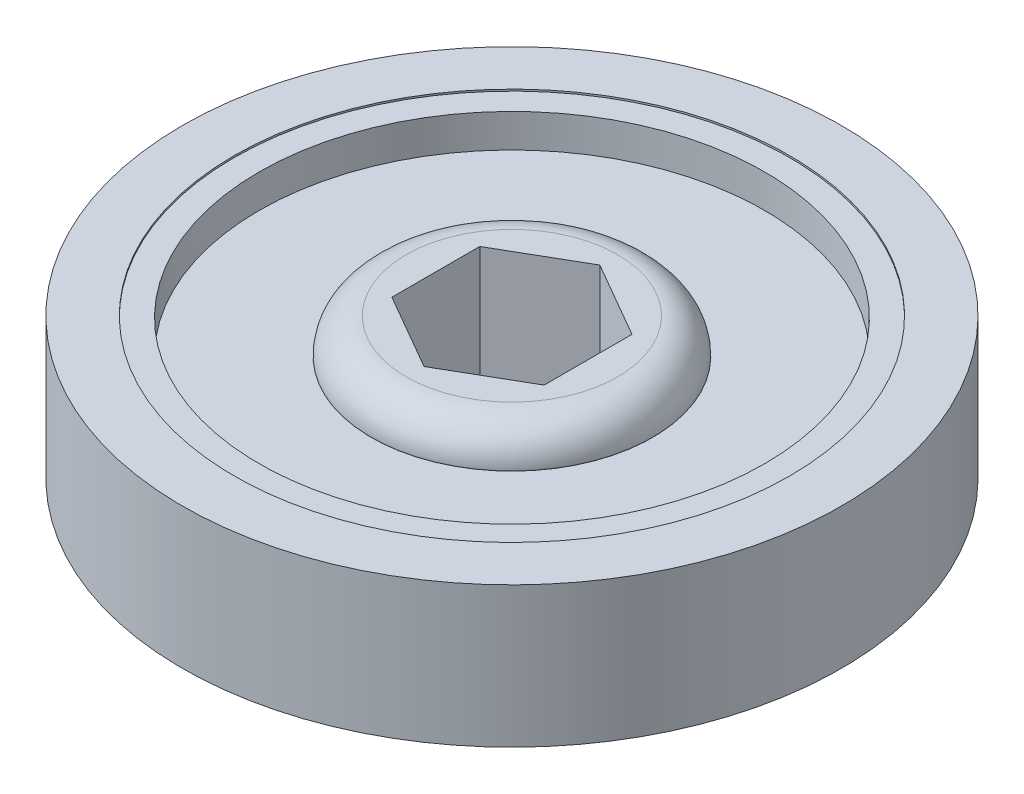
from build123d import *

# Parameters (mm, degrees)
CUT_EXTRUDE1_DEPTH = 36.175217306


with BuildPart() as part:
    # Sketch2 → Revolve1 (revolve)
    with BuildSketch(Plane.XY, mode=Mode.PRIVATE) as revolve1_sk:
        with BuildLine():
            Line((0, 0), (7.6454, 0))
            ThreePointArc((7.6454, 0), (9.423490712, -0.736509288), (10.16, -2.5146))
            Line((10.16, -2.5146), (10.16, -2.54))
            Line((10.16, -2.54), (18.26278597, -2.54))
            Line((18.26278597, -2.54), (18.26278597, -0.127))
            Line((18.26278597, -0.127), (20.060873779, -0.127))
            Line((20.060873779, -0.127), (20.060873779, 0))
            Line((20.060873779, 0), (23.8125, 0))
            Line((23.8125, 0), (23.8125, -10.16))
            Line((23.8125, -10.16), (20.060873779, -10.16))
            Line((20.060873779, -10.16), (20.060873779, -10.033))
            Line((20.060873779, -10.033), (18.26278597, -10.033))
            Line((18.26278597, -10.033), (18.26278597, -7.62))
            Line((18.26278597, -7.62), (10.16, -7.62))
            Line((10.16, -7.62), (10.16, -7.6454))
            ThreePointArc((10.16, -7.6454), (9.423490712, -9.423490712), (7.6454, -10.16))
            Line((7.6454, -10.16), (0, -10.16))
            Line((0, -10.16), (0, 0))
        make_face()
    revolve(revolve1_sk.sketch.rotate(Axis((0, 0, 0), (0, -1, 0)), 180), axis=Axis((0, 0, 0), (0, -1, 0)))

    # Sketch3 → Cut-Extrude1 (cut, through all)
    with BuildSketch(Plane(origin=(0, 0, 0), x_dir=(1, 0, 0), z_dir=(0, 1, 0))):
        Polygon((0, 6.35), (-5.499261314, 3.175), (-5.499261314, -3.175), (0, -6.35), (5.499261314, -3.175), (5.499261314, 3.175), align=None)
    extrude(amount=-CUT_EXTRUDE1_DEPTH, mode=Mode.SUBTRACT)


solid = part.part
